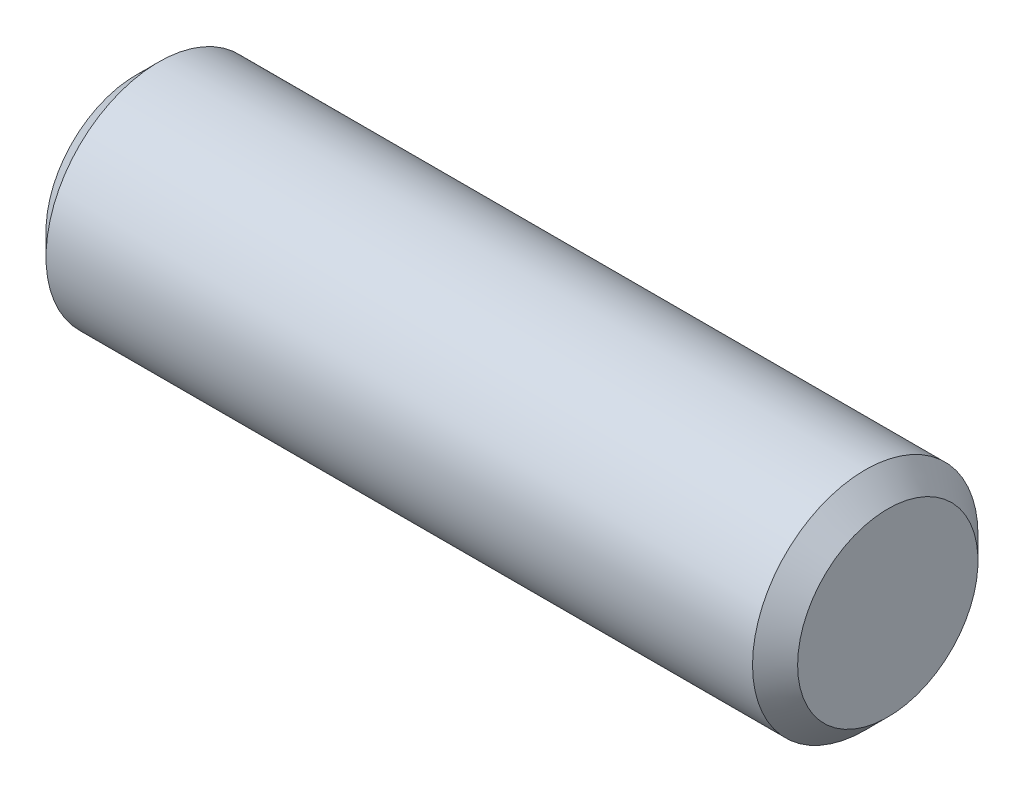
from build123d import *

# Parameters (mm, degrees)
EXTRUDE1_DEPTH      = 3.96875
EXTRUDE1_DEPTH_BACK = 3.96875
SKETCH2_R           = 1.190625
CHAMFER1_SIZE       = 0.238125


with BuildPart() as part:
    # Sketch2 → Extrude1 (new, two sides: drawn at the far end of the back side and taken through both)
    with BuildSketch(Plane(origin=(0, 0, 0), x_dir=(0, 0, -1), z_dir=(1, 0, 0)).offset(-EXTRUDE1_DEPTH_BACK)):
        Circle(SKETCH2_R)
    extrude(amount=EXTRUDE1_DEPTH + EXTRUDE1_DEPTH_BACK)

    # Chamfer1
    chamfer1_edges = [part.edges().sort_by_distance(p)[0] for p in [
        (-3.96875, 0, 1.190625),
        (3.96875, 0, 1.190625),
    ]]
    chamfer(chamfer1_edges, length=CHAMFER1_SIZE)


solid = part.part
